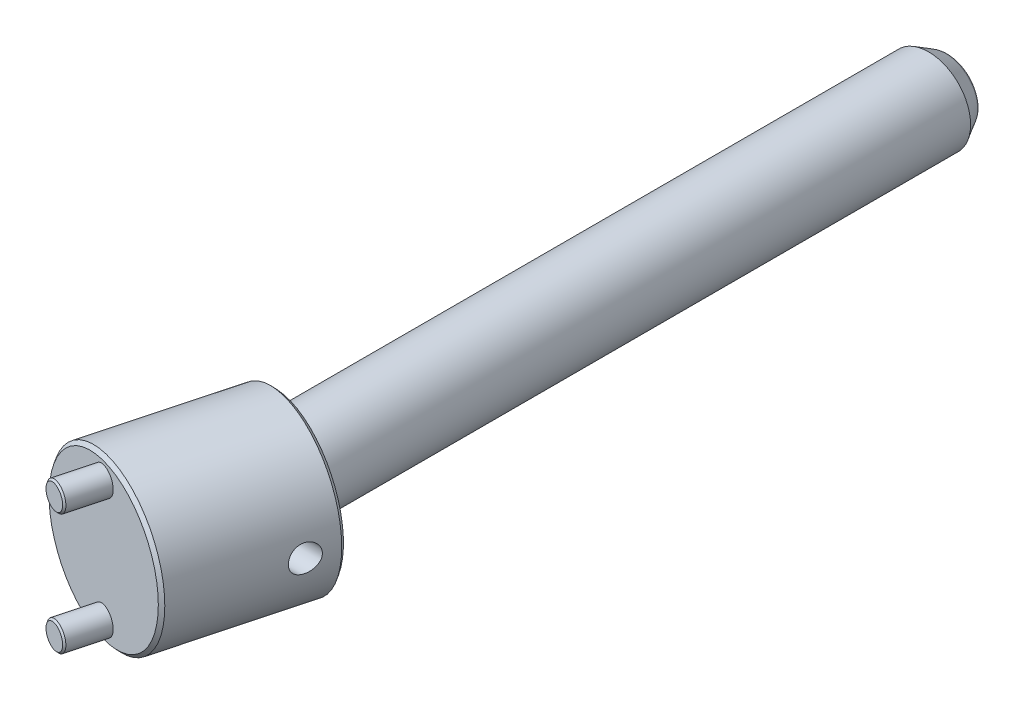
ISO-10303-21;
HEADER;
FILE_DESCRIPTION(('STEP AP214'),'2;1');
FILE_NAME('part.step','',(''),(''),'','','');
FILE_SCHEMA(('AUTOMOTIVE_DESIGN { 1 0 10303 214 1 1 1 1 }'));
ENDSEC;
DATA;
#1=APPLICATION_CONTEXT('core data for automotive mechanical design processes');
#2=APPLICATION_PROTOCOL_DEFINITION('international standard','automotive_design',2000,#1);
#3=PRODUCT_CONTEXT('',#1,'mechanical');
#4=PRODUCT('Part','Part','',(#3));
#5=PRODUCT_RELATED_PRODUCT_CATEGORY('part','',(#4));
#6=PRODUCT_DEFINITION_FORMATION('','',#4);
#7=PRODUCT_DEFINITION_CONTEXT('part definition',#1,'design');
#8=PRODUCT_DEFINITION('design','',#6,#7);
#9=PRODUCT_DEFINITION_SHAPE('','',#8);
#10=(LENGTH_UNIT() NAMED_UNIT(*) SI_UNIT(.MILLI.,.METRE.));
#11=(NAMED_UNIT(*) PLANE_ANGLE_UNIT() SI_UNIT($,.RADIAN.));
#12=(NAMED_UNIT(*) SI_UNIT($,.STERADIAN.) SOLID_ANGLE_UNIT());
#13=UNCERTAINTY_MEASURE_WITH_UNIT(LENGTH_MEASURE(1.E-05),#10,'distance_accuracy_value','');
#14=(GEOMETRIC_REPRESENTATION_CONTEXT(3) GLOBAL_UNCERTAINTY_ASSIGNED_CONTEXT((#13)) GLOBAL_UNIT_ASSIGNED_CONTEXT((#10,
#11,#12)) REPRESENTATION_CONTEXT('',''));
#15=CARTESIAN_POINT('',(0.,0.,0.));
#16=DIRECTION('',(0.,0.,1.));
#17=DIRECTION('',(1.,0.,0.));
#18=AXIS2_PLACEMENT_3D('',#15,#16,#17);
#19=CARTESIAN_POINT('',(-9.92305643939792,0.,56.3518673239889));
#20=DIRECTION('',(-0.258819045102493,0.,0.965925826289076));
#21=DIRECTION('',(-0.965925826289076,0.,-0.258819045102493));
#22=AXIS2_PLACEMENT_3D('',#19,#20,#21);
#23=PLANE('',#22);
#24=CARTESIAN_POINT('',(-9.92305643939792,18.,56.3518673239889));
#25=DIRECTION('',(-0.258819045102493,0.,0.965925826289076));
#26=DIRECTION('',(-0.965925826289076,0.,-0.258819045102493));
#27=AXIS2_PLACEMENT_3D('',#24,#25,#26);
#28=CIRCLE('',#27,3.50000030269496);
#29=CARTESIAN_POINT('',(-13.3037971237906,18.,55.446000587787));
#30=VERTEX_POINT('',#29);
#31=EDGE_CURVE('P0_E17',#30,#30,#28,.F.);
#32=ORIENTED_EDGE('',*,*,#31,.F.);
#33=EDGE_LOOP('',(#32));
#34=FACE_BOUND('',#33,.T.);
#35=ADVANCED_FACE('P0_F14',(#34),#23,.T.);
#36=CARTESIAN_POINT('',(-9.92305643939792,0.,56.3518673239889));
#37=DIRECTION('',(-0.258819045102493,0.,0.965925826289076));
#38=DIRECTION('',(-0.965925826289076,0.,-0.258819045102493));
#39=AXIS2_PLACEMENT_3D('',#36,#37,#38);
#40=PLANE('',#39);
#41=CARTESIAN_POINT('',(-9.92305643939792,-18.,56.3518673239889));
#42=DIRECTION('',(-0.258819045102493,0.,0.965925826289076));
#43=DIRECTION('',(-0.965925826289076,0.,-0.258819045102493));
#44=AXIS2_PLACEMENT_3D('',#41,#42,#43);
#45=CIRCLE('',#44,3.50000030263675);
#46=CARTESIAN_POINT('',(-13.3037971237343,-18.,55.446000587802));
#47=VERTEX_POINT('',#46);
#48=EDGE_CURVE('P0_E121',#47,#47,#45,.F.);
#49=ORIENTED_EDGE('',*,*,#48,.F.);
#50=EDGE_LOOP('',(#49));
#51=FACE_BOUND('',#50,.T.);
#52=ADVANCED_FACE('P0_F111',(#51),#40,.T.);
#53=CARTESIAN_POINT('',(3.59087759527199E-13,0.,37.4999999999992));
#54=DIRECTION('',(0.,0.,1.));
#55=DIRECTION('',(-1.,0.,0.));
#56=AXIS2_PLACEMENT_3D('',#53,#54,#55);
#57=PLANE('',#56);
#58=CARTESIAN_POINT('',(-9.31546506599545E-13,0.,37.4999999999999));
#59=DIRECTION('',(0.,0.,1.));
#60=DIRECTION('',(-1.,0.,0.));
#61=AXIS2_PLACEMENT_3D('',#58,#59,#60);
#62=CIRCLE('',#61,12.5);
#63=CARTESIAN_POINT('',(-12.5000000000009,0.,37.4999999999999));
#64=VERTEX_POINT('',#63);
#65=EDGE_CURVE('P0_E36',#64,#64,#62,.F.);
#66=ORIENTED_EDGE('',*,*,#65,.T.);
#67=EDGE_LOOP('',(#66));
#68=FACE_BOUND('',#67,.T.);
#69=ADVANCED_FACE('P0_F108',(#68),#57,.F.);
#70=CARTESIAN_POINT('',(-9.79364661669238,18.,55.8689032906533));
#71=DIRECTION('',(0.258819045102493,0.,-0.965925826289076));
#72=DIRECTION('',(0.965925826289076,0.,0.258819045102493));
#73=AXIS2_PLACEMENT_3D('',#70,#71,#72);
#74=CONICAL_SURFACE('',#73,4.00000150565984,0.785398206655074);
#75=CARTESIAN_POINT('',(-9.79364622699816,18.,55.8689018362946));
#76=DIRECTION('',(-0.258819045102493,0.,0.965925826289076));
#77=DIRECTION('',(-0.965925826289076,0.,-0.258819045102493));
#78=AXIS2_PLACEMENT_3D('',#75,#76,#77);
#79=CIRCLE('',#78,4.);
#80=CARTESIAN_POINT('',(-13.6573495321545,18.,54.8336256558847));
#81=VERTEX_POINT('',#80);
#82=EDGE_CURVE('P0_E33',#81,#81,#79,.F.);
#83=ORIENTED_EDGE('',*,*,#82,.F.);
#84=EDGE_LOOP('',(#83));
#85=FACE_BOUND('',#84,.T.);
#86=ORIENTED_EDGE('',*,*,#31,.T.);
#87=EDGE_LOOP('',(#86));
#88=FACE_BOUND('',#87,.T.);
#89=ADVANCED_FACE('P0_F104',(#85,#88),#74,.T.);
#90=CARTESIAN_POINT('',(-9.79364661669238,-18.,55.8689032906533));
#91=DIRECTION('',(0.258819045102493,0.,-0.965925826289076));
#92=DIRECTION('',(0.965925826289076,0.,0.258819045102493));
#93=AXIS2_PLACEMENT_3D('',#90,#91,#92);
#94=CONICAL_SURFACE('',#93,4.00000150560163,0.785398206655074);
#95=CARTESIAN_POINT('',(-9.79364622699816,-18.,55.8689018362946));
#96=DIRECTION('',(-0.258819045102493,0.,0.965925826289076));
#97=DIRECTION('',(-0.965925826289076,0.,-0.258819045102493));
#98=AXIS2_PLACEMENT_3D('',#95,#96,#97);
#99=CIRCLE('',#98,4.);
#100=CARTESIAN_POINT('',(-13.6573495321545,-18.,54.8336256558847));
#101=VERTEX_POINT('',#100);
#102=EDGE_CURVE('P0_E29',#101,#101,#99,.F.);
#103=ORIENTED_EDGE('',*,*,#102,.F.);
#104=EDGE_LOOP('',(#103));
#105=FACE_BOUND('',#104,.T.);
#106=ORIENTED_EDGE('',*,*,#48,.T.);
#107=EDGE_LOOP('',(#106));
#108=FACE_BOUND('',#107,.T.);
#109=ADVANCED_FACE('P0_F99',(#105,#108),#94,.T.);
#110=CARTESIAN_POINT('',(-9.33281230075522E-13,0.,-15.8125000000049));
#111=DIRECTION('',(0.,0.,1.));
#112=DIRECTION('',(-1.,0.,0.));
#113=AXIS2_PLACEMENT_3D('',#110,#111,#112);
#114=CYLINDRICAL_SURFACE('',#113,12.5);
#115=CARTESIAN_POINT('',(-9.31546506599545E-13,0.,-8.11850586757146E-13));
#116=DIRECTION('',(0.258819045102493,0.,-0.965925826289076));
#117=DIRECTION('',(0.965925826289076,0.,0.258819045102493));
#118=AXIS2_PLACEMENT_3D('',#115,#116,#117);
#119=ELLIPSE('',#118,12.9409522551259,12.5);
#120=CARTESIAN_POINT('',(12.4999999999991,0.,3.34936490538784));
#121=VERTEX_POINT('',#120);
#122=EDGE_CURVE('P0_E32',#121,#121,#119,.F.);
#123=ORIENTED_EDGE('',*,*,#122,.F.);
#124=EDGE_LOOP('',(#123));
#125=FACE_BOUND('',#124,.T.);
#126=ORIENTED_EDGE('',*,*,#65,.F.);
#127=EDGE_LOOP('',(#126));
#128=FACE_BOUND('',#127,.T.);
#129=CARTESIAN_POINT('',(12.4999999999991,0.,12.9999999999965));
#130=CARTESIAN_POINT('',(12.4999998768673,0.109267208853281,13.000000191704));
#131=CARTESIAN_POINT('',(12.4985638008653,0.218537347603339,13.0044812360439));
#132=CARTESIAN_POINT('',(12.4928582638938,0.436308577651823,13.0223652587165));
#133=CARTESIAN_POINT('',(12.4885877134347,0.544809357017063,13.0357716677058));
#134=CARTESIAN_POINT('',(12.4773197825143,0.760358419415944,13.0714127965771));
#135=CARTESIAN_POINT('',(12.4703188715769,0.867404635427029,13.0936589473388));
#136=CARTESIAN_POINT('',(12.4537844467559,1.07914970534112,13.1467710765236));
#137=CARTESIAN_POINT('',(12.4442499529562,1.18384763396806,13.1776403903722));
#138=CARTESIAN_POINT('',(12.41226080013,1.49277788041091,13.2826442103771));
#139=CARTESIAN_POINT('',(12.3863805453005,1.69256281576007,13.3692944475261));
#140=CARTESIAN_POINT('',(12.32816104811,2.07458913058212,13.5731871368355));
#141=CARTESIAN_POINT('',(12.295822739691,2.25683304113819,13.6904251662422));
#142=CARTESIAN_POINT('',(12.2269279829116,2.60472253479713,13.9562044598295));
#143=CARTESIAN_POINT('',(12.1902760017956,2.76972880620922,14.10555914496));
#144=CARTESIAN_POINT('',(12.1174284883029,3.07283077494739,14.4295989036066));
#145=CARTESIAN_POINT('',(12.0812330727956,3.21091970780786,14.6042903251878));
#146=CARTESIAN_POINT('',(12.0123702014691,3.45978450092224,14.9796324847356));
#147=CARTESIAN_POINT('',(11.9798194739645,3.56975347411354,15.1808417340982));
#148=CARTESIAN_POINT('',(11.9233663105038,3.75402351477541,15.6001070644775));
#149=CARTESIAN_POINT('',(11.8994614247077,3.82833468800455,15.818158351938));
#150=CARTESIAN_POINT('',(11.8640030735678,3.93682830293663,16.2577064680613));
#151=CARTESIAN_POINT('',(11.8520853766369,3.97219740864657,16.4788801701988));
#152=CARTESIAN_POINT('',(11.840870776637,4.00551082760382,16.9243189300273));
#153=CARTESIAN_POINT('',(11.8415703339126,4.00346563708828,17.1485831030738));
#154=CARTESIAN_POINT('',(11.855190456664,3.96293460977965,17.5839134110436));
#155=CARTESIAN_POINT('',(11.86760035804,3.92597140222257,17.7951400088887));
#156=CARTESIAN_POINT('',(11.9024113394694,3.81912665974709,18.2082211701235));
#157=CARTESIAN_POINT('',(11.9248135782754,3.74924130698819,18.4100746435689));
#158=CARTESIAN_POINT('',(11.9774670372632,3.5774893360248,18.8022499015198));
#159=CARTESIAN_POINT('',(12.0078322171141,3.47515345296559,18.9923501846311));
#160=CARTESIAN_POINT('',(12.0729382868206,3.2417276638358,19.353165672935));
#161=CARTESIAN_POINT('',(12.107680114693,3.11063158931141,19.5238767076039));
#162=CARTESIAN_POINT('',(12.1796519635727,2.81604951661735,19.8496284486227));
#163=CARTESIAN_POINT('',(12.2169216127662,2.65131653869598,20.0035328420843));
#164=CARTESIAN_POINT('',(12.2883204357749,2.29773509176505,20.2819176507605));
#165=CARTESIAN_POINT('',(12.3224482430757,2.10887621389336,20.4063852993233));
#166=CARTESIAN_POINT('',(12.3686038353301,1.8105187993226,20.5686214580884));
#167=CARTESIAN_POINT('',(12.3832112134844,1.70799133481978,20.6188153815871));
#168=CARTESIAN_POINT('',(12.4102662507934,1.49879447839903,20.7103404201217));
#169=CARTESIAN_POINT('',(12.4227147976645,1.39212681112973,20.751675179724));
#170=CARTESIAN_POINT('',(12.4450730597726,1.17558171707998,20.8250571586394));
#171=CARTESIAN_POINT('',(12.4549867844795,1.0657096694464,20.8571190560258));
#172=CARTESIAN_POINT('',(12.4720081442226,0.843458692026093,20.9117338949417));
#173=CARTESIAN_POINT('',(12.4791170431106,0.731080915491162,20.9342911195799));
#174=CARTESIAN_POINT('',(12.4897717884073,0.515800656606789,20.9679498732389));
#175=CARTESIAN_POINT('',(12.4935992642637,0.413053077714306,20.9799597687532));
#176=CARTESIAN_POINT('',(12.498713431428,0.206871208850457,20.9959849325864));
#177=CARTESIAN_POINT('',(12.5000001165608,0.103436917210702,21.0000001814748));
#178=CARTESIAN_POINT('',(12.4999998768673,-0.109267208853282,20.9999998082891));
#179=CARTESIAN_POINT('',(12.4985638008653,-0.21853734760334,20.9955187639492));
#180=CARTESIAN_POINT('',(12.4928582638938,-0.436308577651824,20.9776347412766));
#181=CARTESIAN_POINT('',(12.4885877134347,-0.544809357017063,20.9642283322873));
#182=CARTESIAN_POINT('',(12.4773197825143,-0.760358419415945,20.928587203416));
#183=CARTESIAN_POINT('',(12.4703188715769,-0.86740463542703,20.9063410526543));
#184=CARTESIAN_POINT('',(12.4537844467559,-1.07914970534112,20.8532289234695));
#185=CARTESIAN_POINT('',(12.4442499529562,-1.18384763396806,20.8223596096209));
#186=CARTESIAN_POINT('',(12.41226080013,-1.4927778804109,20.717355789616));
#187=CARTESIAN_POINT('',(12.3863805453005,-1.69256281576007,20.630705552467));
#188=CARTESIAN_POINT('',(12.32816104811,-2.07458913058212,20.4268128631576));
#189=CARTESIAN_POINT('',(12.295822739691,-2.25683304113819,20.3095748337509));
#190=CARTESIAN_POINT('',(12.2269279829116,-2.60472253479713,20.0437955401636));
#191=CARTESIAN_POINT('',(12.1902760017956,-2.76972880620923,19.8944408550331));
#192=CARTESIAN_POINT('',(12.1174284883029,-3.0728307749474,19.5704010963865));
#193=CARTESIAN_POINT('',(12.0812330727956,-3.21091970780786,19.3957096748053));
#194=CARTESIAN_POINT('',(12.0123702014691,-3.45978450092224,19.0203675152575));
#195=CARTESIAN_POINT('',(11.9798194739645,-3.56975347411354,18.8191582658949));
#196=CARTESIAN_POINT('',(11.9233663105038,-3.75402351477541,18.3998929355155));
#197=CARTESIAN_POINT('',(11.8994614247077,-3.82833468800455,18.1818416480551));
#198=CARTESIAN_POINT('',(11.8640030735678,-3.93682830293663,17.7422935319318));
#199=CARTESIAN_POINT('',(11.8520853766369,-3.97219740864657,17.5211198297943));
#200=CARTESIAN_POINT('',(11.840870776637,-4.00551082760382,17.0756810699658));
#201=CARTESIAN_POINT('',(11.8415703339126,-4.00346563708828,16.8514168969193));
#202=CARTESIAN_POINT('',(11.855190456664,-3.96293460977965,16.4160865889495));
#203=CARTESIAN_POINT('',(11.86760035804,-3.92597140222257,16.2048599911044));
#204=CARTESIAN_POINT('',(11.9024113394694,-3.81912665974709,15.7917788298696));
#205=CARTESIAN_POINT('',(11.9248135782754,-3.74924130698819,15.5899253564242));
#206=CARTESIAN_POINT('',(11.9774670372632,-3.5774893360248,15.1977500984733));
#207=CARTESIAN_POINT('',(12.0078322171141,-3.47515345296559,15.007649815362));
#208=CARTESIAN_POINT('',(12.0729382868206,-3.2417276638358,14.6468343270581));
#209=CARTESIAN_POINT('',(12.107680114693,-3.11063158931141,14.4761232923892));
#210=CARTESIAN_POINT('',(12.1796519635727,-2.81604951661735,14.1503715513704));
#211=CARTESIAN_POINT('',(12.2169216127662,-2.65131653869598,13.9964671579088));
#212=CARTESIAN_POINT('',(12.2883204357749,-2.29773509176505,13.7180823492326));
#213=CARTESIAN_POINT('',(12.3224482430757,-2.10887621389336,13.5936147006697));
#214=CARTESIAN_POINT('',(12.3686038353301,-1.8105187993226,13.4313785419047));
#215=CARTESIAN_POINT('',(12.3832112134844,-1.70799133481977,13.381184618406));
#216=CARTESIAN_POINT('',(12.4102662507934,-1.49879447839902,13.2896595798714));
#217=CARTESIAN_POINT('',(12.4227147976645,-1.39212681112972,13.2483248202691));
#218=CARTESIAN_POINT('',(12.4450730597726,-1.17558171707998,13.1749428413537));
#219=CARTESIAN_POINT('',(12.4549867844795,-1.0657096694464,13.1428809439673));
#220=CARTESIAN_POINT('',(12.4720081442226,-0.843458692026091,13.0882661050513));
#221=CARTESIAN_POINT('',(12.4791170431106,-0.731080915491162,13.0657088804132));
#222=CARTESIAN_POINT('',(12.4897717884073,-0.51580065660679,13.0320501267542));
#223=CARTESIAN_POINT('',(12.4935992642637,-0.413053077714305,13.0200402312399));
#224=CARTESIAN_POINT('',(12.498713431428,-0.206871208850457,13.0040150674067));
#225=CARTESIAN_POINT('',(12.5000001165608,-0.103436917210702,12.9999998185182));
#226=CARTESIAN_POINT('',(12.4999999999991,0.,12.9999999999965));
#227=B_SPLINE_CURVE_WITH_KNOTS('',3,(#129,#130,#131,#132,#133,#134,#135,#136,#137,#138,#139,
#140,#141,#142,#143,#144,#145,#146,#147,#148,#149,#150,#151,#152,#153,#154,#155,#156,#157,#158,
#159,#160,#161,#162,#163,#164,#165,#166,#167,#168,#169,#170,#171,#172,#173,#174,#175,#176,#177,
#178,#179,#180,#181,#182,#183,#184,#185,#186,#187,#188,#189,#190,#191,#192,#193,#194,#195,#196,
#197,#198,#199,#200,#201,#202,#203,#204,#205,#206,#207,#208,#209,#210,#211,#212,#213,#214,#215,
#216,#217,#218,#219,#220,#221,#222,#223,#224,#225,#226),.UNSPECIFIED.,.T.,.F.,(4,2,2,2,2,2,2,2,
2,2,2,2,2,2,2,2,2,2,2,2,2,2,2,2,2,2,2,2,2,2,2,2,2,2,2,2,2,2,2,2,2,2,2,2,2,2,2,2,4),(0.,
0.327705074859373,0.655536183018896,0.983792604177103,1.31217617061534,1.9667891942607,
2.62130761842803,3.29492000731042,3.96870146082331,4.66006760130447,5.35123768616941,
6.0207071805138,6.68998886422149,7.33137068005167,7.97282689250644,8.62401811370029,
9.27534913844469,9.95775723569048,10.6404607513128,10.9853574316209,11.3301119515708,
11.6743177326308,12.0183682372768,12.3285868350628,12.6388061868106,12.9665112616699,
13.2943423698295,13.6225987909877,13.9509823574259,14.6055953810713,15.2601138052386,
15.933726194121,16.6075076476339,17.298873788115,17.99004387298,18.6595133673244,
19.3287950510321,19.9701768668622,20.611633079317,21.2628243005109,21.9141553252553,
22.596563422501,23.2792669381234,23.6241636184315,23.9689181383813,24.3131239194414,
24.6571744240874,24.9673930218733,25.2776123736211),.UNSPECIFIED.);
#228=CARTESIAN_POINT('',(12.4999999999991,0.,12.9999999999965));
#229=VERTEX_POINT('',#228);
#230=EDGE_CURVE('P0_E84',#229,#229,#227,.T.);
#231=ORIENTED_EDGE('',*,*,#230,.T.);
#232=EDGE_LOOP('',(#231));
#233=FACE_BOUND('',#232,.T.);
#234=ADVANCED_FACE('P0_F93',(#125,#128,#233),#114,.F.);
#235=CARTESIAN_POINT('',(-6.817227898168,18.,44.76075740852));
#236=DIRECTION('',(-0.258819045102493,0.,0.965925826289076));
#237=DIRECTION('',(-0.965925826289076,0.,-0.258819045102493));
#238=AXIS2_PLACEMENT_3D('',#235,#236,#237);
#239=CYLINDRICAL_SURFACE('',#238,4.);
#240=CARTESIAN_POINT('',(-6.817227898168,18.,44.76075740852));
#241=DIRECTION('',(-0.258819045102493,0.,0.965925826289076));
#242=DIRECTION('',(-0.965925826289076,0.,-0.258819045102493));
#243=AXIS2_PLACEMENT_3D('',#240,#241,#242);
#244=CIRCLE('',#243,4.);
#245=CARTESIAN_POINT('',(-10.6809312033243,18.,43.72548122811));
#246=VERTEX_POINT('',#245);
#247=EDGE_CURVE('P0_E80',#246,#246,#244,.T.);
#248=ORIENTED_EDGE('',*,*,#247,.T.);
#249=EDGE_LOOP('',(#248));
#250=FACE_BOUND('',#249,.T.);
#251=ORIENTED_EDGE('',*,*,#82,.T.);
#252=EDGE_LOOP('',(#251));
#253=FACE_BOUND('',#252,.T.);
#254=ADVANCED_FACE('P0_F98',(#250,#253),#239,.T.);
#255=CARTESIAN_POINT('',(-6.817227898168,-18.,44.76075740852));
#256=DIRECTION('',(-0.258819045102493,0.,0.965925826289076));
#257=DIRECTION('',(-0.965925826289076,0.,-0.258819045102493));
#258=AXIS2_PLACEMENT_3D('',#255,#256,#257);
#259=CYLINDRICAL_SURFACE('',#258,4.);
#260=CARTESIAN_POINT('',(-6.817227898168,-18.,44.76075740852));
#261=DIRECTION('',(-0.258819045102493,0.,0.965925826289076));
#262=DIRECTION('',(-0.965925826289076,0.,-0.258819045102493));
#263=AXIS2_PLACEMENT_3D('',#260,#261,#262);
#264=CIRCLE('',#263,4.);
#265=CARTESIAN_POINT('',(-10.6809312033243,-18.,43.72548122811));
#266=VERTEX_POINT('',#265);
#267=EDGE_CURVE('P0_E76',#266,#266,#264,.T.);
#268=ORIENTED_EDGE('',*,*,#267,.T.);
#269=EDGE_LOOP('',(#268));
#270=FACE_BOUND('',#269,.T.);
#271=ORIENTED_EDGE('',*,*,#102,.T.);
#272=EDGE_LOOP('',(#271));
#273=FACE_BOUND('',#272,.T.);
#274=ADVANCED_FACE('P0_F178',(#270,#273),#259,.T.);
#275=CARTESIAN_POINT('',(4.82962913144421,0.,1.29409522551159));
#276=DIRECTION('',(0.258819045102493,0.,-0.965925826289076));
#277=DIRECTION('',(0.965925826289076,0.,0.258819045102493));
#278=AXIS2_PLACEMENT_3D('',#275,#276,#277);
#279=PLANE('',#278);
#280=ORIENTED_EDGE('',*,*,#122,.T.);
#281=EDGE_LOOP('',(#280));
#282=FACE_BOUND('',#281,.T.);
#283=CARTESIAN_POINT('',(4.82962908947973,0.,1.2940953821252));
#284=DIRECTION('',(-0.258819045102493,0.,0.965925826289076));
#285=DIRECTION('',(-0.965925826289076,0.,-0.258819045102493));
#286=AXIS2_PLACEMENT_3D('',#283,#284,#285);
#287=CIRCLE('',#286,22.9999993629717);
#288=CARTESIAN_POINT('',(-17.3866642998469,0.,-4.65874249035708));
#289=VERTEX_POINT('',#288);
#290=EDGE_CURVE('P0_E46',#289,#289,#287,.T.);
#291=ORIENTED_EDGE('',*,*,#290,.F.);
#292=EDGE_LOOP('',(#291));
#293=FACE_BOUND('',#292,.T.);
#294=ADVANCED_FACE('P0_F71',(#282,#293),#279,.T.);
#295=CARTESIAN_POINT('',(-6.54102540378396,0.,16.9999999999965));
#296=DIRECTION('',(1.,0.,0.));
#297=DIRECTION('',(0.,0.,1.));
#298=AXIS2_PLACEMENT_3D('',#295,#296,#297);
#299=CYLINDRICAL_SURFACE('',#298,4.);
#300=ORIENTED_EDGE('',*,*,#230,.F.);
#301=EDGE_LOOP('',(#300));
#302=FACE_BOUND('',#301,.T.);
#303=CARTESIAN_POINT('',(24.3960761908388,0.,20.9999999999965));
#304=CARTESIAN_POINT('',(24.396074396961,0.22336487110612,20.9999897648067));
#305=CARTESIAN_POINT('',(24.3978452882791,0.446995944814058,20.9812165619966));
#306=CARTESIAN_POINT('',(24.4051444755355,0.888215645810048,20.9065721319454));
#307=CARTESIAN_POINT('',(24.410679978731,1.10579184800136,20.8506297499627));
#308=CARTESIAN_POINT('',(24.4261201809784,1.52829524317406,20.703282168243));
#309=CARTESIAN_POINT('',(24.4360219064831,1.73323093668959,20.6119011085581));
#310=CARTESIAN_POINT('',(24.4610831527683,2.12464373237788,20.3964369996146));
#311=CARTESIAN_POINT('',(24.4762403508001,2.31112894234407,20.2723684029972));
#312=CARTESIAN_POINT('',(24.5128103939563,2.66027335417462,19.9954190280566));
#313=CARTESIAN_POINT('',(24.5342162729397,2.82295878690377,19.8425704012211));
#314=CARTESIAN_POINT('',(24.5842187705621,3.12024067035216,19.5126495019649));
#315=CARTESIAN_POINT('',(24.6128156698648,3.25483602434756,19.3355762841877));
#316=CARTESIAN_POINT('',(24.677846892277,3.49248622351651,18.9625212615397));
#317=CARTESIAN_POINT('',(24.7142870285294,3.59551753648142,18.7665254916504));
#318=CARTESIAN_POINT('',(24.7951246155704,3.76752154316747,18.3616777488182));
#319=CARTESIAN_POINT('',(24.8395223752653,3.83649291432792,18.1528252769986));
#320=CARTESIAN_POINT('',(24.9365267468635,3.93995184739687,17.7251836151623));
#321=CARTESIAN_POINT('',(24.9892449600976,3.97391481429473,17.5062931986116));
#322=CARTESIAN_POINT('',(25.1012847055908,4.00547425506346,17.0675971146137));
#323=CARTESIAN_POINT('',(25.1606074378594,4.00306410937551,16.8477912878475));
#324=CARTESIAN_POINT('',(25.286383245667,3.96197806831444,16.4051046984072));
#325=CARTESIAN_POINT('',(25.353015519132,3.92200742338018,16.1823953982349));
#326=CARTESIAN_POINT('',(25.4891731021,3.80555513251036,15.747634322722));
#327=CARTESIAN_POINT('',(25.5586991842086,3.72906367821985,15.5355854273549));
#328=CARTESIAN_POINT('',(25.7005200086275,3.53804999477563,15.1193979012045));
#329=CARTESIAN_POINT('',(25.7728177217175,3.42216994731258,14.9158834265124));
#330=CARTESIAN_POINT('',(25.9140135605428,3.15592185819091,14.5312374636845));
#331=CARTESIAN_POINT('',(25.9829114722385,3.00555164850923,14.3501073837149));
#332=CARTESIAN_POINT('',(26.0807528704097,2.75692219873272,14.0994318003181));
#333=CARTESIAN_POINT('',(26.1124676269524,2.67013706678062,14.0193319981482));
#334=CARTESIAN_POINT('',(26.1735791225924,2.48935348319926,13.8667774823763));
#335=CARTESIAN_POINT('',(26.202976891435,2.39535827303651,13.794319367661));
#336=CARTESIAN_POINT('',(26.258982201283,2.20066954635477,13.6576635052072));
#337=CARTESIAN_POINT('',(26.2855879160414,2.09997171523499,13.5934711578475));
#338=CARTESIAN_POINT('',(26.3354932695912,1.89266146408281,13.4740775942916));
#339=CARTESIAN_POINT('',(26.3587946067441,1.78605212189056,13.4188717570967));
#340=CARTESIAN_POINT('',(26.4003939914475,1.57406734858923,13.3209873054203));
#341=CARTESIAN_POINT('',(26.4189050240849,1.4689847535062,13.2777646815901));
#342=CARTESIAN_POINT('',(26.452252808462,1.25505058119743,13.2002919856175));
#343=CARTESIAN_POINT('',(26.4670914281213,1.14620095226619,13.1660373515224));
#344=CARTESIAN_POINT('',(26.492784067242,0.925790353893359,13.1069417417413));
#345=CARTESIAN_POINT('',(26.5036472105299,0.814236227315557,13.082079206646));
#346=CARTESIAN_POINT('',(26.5212085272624,0.589142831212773,13.0419746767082));
#347=CARTESIAN_POINT('',(26.5279093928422,0.47560489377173,13.0267264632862));
#348=CARTESIAN_POINT('',(26.5348605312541,0.301498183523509,13.010922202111));
#349=CARTESIAN_POINT('',(26.5366627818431,0.241289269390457,13.0068281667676));
#350=CARTESIAN_POINT('',(26.5390675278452,0.120722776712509,13.0013668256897));
#351=CARTESIAN_POINT('',(26.5396700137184,0.0603651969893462,12.9999995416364));
#352=CARTESIAN_POINT('',(26.5396692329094,-0.105931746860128,13.0000008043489));
#353=CARTESIAN_POINT('',(26.5378125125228,-0.211886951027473,13.0042135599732));
#354=CARTESIAN_POINT('',(26.5304173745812,-0.423042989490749,13.0210222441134));
#355=CARTESIAN_POINT('',(26.5248769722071,-0.52824338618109,13.0336226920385));
#356=CARTESIAN_POINT('',(26.5101984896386,-0.737264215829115,13.067105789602));
#357=CARTESIAN_POINT('',(26.5010540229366,-0.841081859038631,13.0880031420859));
#358=CARTESIAN_POINT('',(26.479333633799,-1.04641216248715,13.1378495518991));
#359=CARTESIAN_POINT('',(26.4667563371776,-1.14792388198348,13.1668018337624));
#360=CARTESIAN_POINT('',(26.4242739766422,-1.44724241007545,13.2651122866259));
#361=CARTESIAN_POINT('',(26.3895546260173,-1.64070757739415,13.3460666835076));
#362=CARTESIAN_POINT('',(26.3094786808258,-2.01073895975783,13.5358620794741));
#363=CARTESIAN_POINT('',(26.2641250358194,-2.1873098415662,13.6446953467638));
#364=CARTESIAN_POINT('',(26.1631694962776,-2.52718810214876,13.892056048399));
#365=CARTESIAN_POINT('',(26.1072150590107,-2.68961765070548,14.0316454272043));
#366=CARTESIAN_POINT('',(25.9893620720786,-2.98921976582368,14.3335692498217));
#367=CARTESIAN_POINT('',(25.927461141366,-3.12638215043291,14.4959128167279));
#368=CARTESIAN_POINT('',(25.7957403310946,-3.38223989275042,14.8524110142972));
#369=CARTESIAN_POINT('',(25.7256755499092,-3.49875562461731,15.0480426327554));
#370=CARTESIAN_POINT('',(25.5852116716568,-3.6970152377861,15.4561195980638));
#371=CARTESIAN_POINT('',(25.51481249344,-3.77875019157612,15.6685692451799));
#372=CARTESIAN_POINT('',(25.3741454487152,-3.90748115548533,16.1128925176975));
#373=CARTESIAN_POINT('',(25.3039724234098,-3.95312943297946,16.345189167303));
#374=CARTESIAN_POINT('',(25.1692372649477,-4.00275350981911,16.8158074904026));
#375=CARTESIAN_POINT('',(25.1046745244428,-4.00673382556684,17.0541285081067));
#376=CARTESIAN_POINT('',(24.9845370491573,-3.97228380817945,17.5249229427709));
#377=CARTESIAN_POINT('',(24.9288087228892,-3.93469783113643,17.7574181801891));
#378=CARTESIAN_POINT('',(24.8261443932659,-3.81859631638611,18.2139848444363));
#379=CARTESIAN_POINT('',(24.779206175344,-3.74009110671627,18.438058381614));
#380=CARTESIAN_POINT('',(24.6963951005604,-3.54797550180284,18.8610602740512));
#381=CARTESIAN_POINT('',(24.6601388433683,-3.43598653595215,19.0606507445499));
#382=CARTESIAN_POINT('',(24.5958853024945,-3.1788576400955,19.4386643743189));
#383=CARTESIAN_POINT('',(24.5678861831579,-3.03372509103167,19.6170922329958));
#384=CARTESIAN_POINT('',(24.5200172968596,-2.71870679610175,19.9425447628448));
#385=CARTESIAN_POINT('',(24.4999509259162,-2.5495830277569,20.0902790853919));
#386=CARTESIAN_POINT('',(24.4659141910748,-2.1885277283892,20.3556736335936));
#387=CARTESIAN_POINT('',(24.4519461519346,-1.99658753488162,20.473322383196));
#388=CARTESIAN_POINT('',(24.4291583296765,-1.5965468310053,20.6743616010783));
#389=CARTESIAN_POINT('',(24.4203123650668,-1.38853477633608,20.7579256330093));
#390=CARTESIAN_POINT('',(24.4068245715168,-0.961628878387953,20.8890823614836));
#391=CARTESIAN_POINT('',(24.4021747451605,-0.742756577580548,20.9367434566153));
#392=CARTESIAN_POINT('',(24.3982592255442,-0.435212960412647,20.9772137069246));
#393=CARTESIAN_POINT('',(24.3974390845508,-0.348403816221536,20.9857515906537));
#394=CARTESIAN_POINT('',(24.3963479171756,-0.174409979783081,20.9971467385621));
#395=CARTESIAN_POINT('',(24.3960768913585,-0.0872252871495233,21.000003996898));
#396=CARTESIAN_POINT('',(24.3960761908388,0.,20.9999999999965));
#397=B_SPLINE_CURVE_WITH_KNOTS('',3,(#303,#304,#305,#306,#307,#308,#309,#310,#311,#312,#313,
#314,#315,#316,#317,#318,#319,#320,#321,#322,#323,#324,#325,#326,#327,#328,#329,#330,#331,#332,
#333,#334,#335,#336,#337,#338,#339,#340,#341,#342,#343,#344,#345,#346,#347,#348,#349,#350,#351,
#352,#353,#354,#355,#356,#357,#358,#359,#360,#361,#362,#363,#364,#365,#366,#367,#368,#369,#370,
#371,#372,#373,#374,#375,#376,#377,#378,#379,#380,#381,#382,#383,#384,#385,#386,#387,#388,#389,
#390,#391,#392,#393,#394,#395,#396),.UNSPECIFIED.,.T.,.F.,(4,2,2,2,2,2,2,2,2,2,2,2,2,2,2,2,2,2,
2,2,2,2,2,2,2,2,2,2,2,2,2,2,2,2,2,2,2,2,2,2,2,2,2,2,2,2,4),(0.,0.669767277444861,
1.34082043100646,2.01141727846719,2.6817181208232,3.35127453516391,4.0208570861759,
4.69093762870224,5.36104418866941,6.04105231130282,6.72118419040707,7.4256558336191,
8.13031678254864,8.86226101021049,9.59425125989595,9.96071586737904,10.3270166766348,
10.6935556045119,11.0599054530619,11.4048180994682,11.7495549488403,12.0934955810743,
12.4372135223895,12.6182737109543,12.7993353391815,13.1170709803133,13.4349779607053,
13.7534508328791,14.0720513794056,14.7066198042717,15.3410124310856,16.0022589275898,
16.6637713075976,17.3752870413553,18.0869852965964,18.8241504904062,19.5612357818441,
20.2836188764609,21.0058197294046,21.6975404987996,22.3891073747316,23.0622604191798,
23.7356698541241,24.40560605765,25.0742627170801,25.3358104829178,25.5973585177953),.UNSPECIFIED.);
#398=CARTESIAN_POINT('',(24.3960761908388,0.,20.9999999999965));
#399=VERTEX_POINT('',#398);
#400=EDGE_CURVE('P0_E39',#399,#399,#397,.T.);
#401=ORIENTED_EDGE('',*,*,#400,.F.);
#402=EDGE_LOOP('',(#401));
#403=FACE_BOUND('',#402,.T.);
#404=ADVANCED_FACE('P0_F48',(#302,#403),#299,.F.);
#405=CARTESIAN_POINT('',(-6.817227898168,0.,44.76075740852));
#406=DIRECTION('',(0.258819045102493,0.,-0.965925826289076));
#407=DIRECTION('',(0.965925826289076,0.,0.258819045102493));
#408=AXIS2_PLACEMENT_3D('',#405,#406,#407);
#409=PLANE('',#408);
#410=ORIENTED_EDGE('',*,*,#267,.F.);
#411=EDGE_LOOP('',(#410));
#412=FACE_BOUND('',#411,.T.);
#413=ORIENTED_EDGE('',*,*,#247,.F.);
#414=EDGE_LOOP('',(#413));
#415=FACE_BOUND('',#414,.T.);
#416=CARTESIAN_POINT('',(-6.81722788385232,0.,44.7607573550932));
#417=DIRECTION('',(0.258819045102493,0.,-0.965925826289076));
#418=DIRECTION('',(0.965925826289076,0.,0.258819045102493));
#419=AXIS2_PLACEMENT_3D('',#416,#417,#418);
#420=CIRCLE('',#419,22.9999993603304);
#421=CARTESIAN_POINT('',(15.399065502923,0.,50.7135952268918));
#422=VERTEX_POINT('',#421);
#423=EDGE_CURVE('P0_E26',#422,#422,#420,.T.);
#424=ORIENTED_EDGE('',*,*,#423,.F.);
#425=EDGE_LOOP('',(#424));
#426=FACE_BOUND('',#425,.T.);
#427=ADVANCED_FACE('P0_F63',(#412,#415,#426),#409,.F.);
#428=CARTESIAN_POINT('',(4.57080991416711,0.,2.26002169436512));
#429=DIRECTION('',(-0.258819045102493,0.,0.965925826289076));
#430=DIRECTION('',(-0.965925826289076,0.,-0.258819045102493));
#431=AXIS2_PLACEMENT_3D('',#428,#429,#430);
#432=CONICAL_SURFACE('',#431,23.9999998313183,0.785398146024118);
#433=ORIENTED_EDGE('',*,*,#290,.T.);
#434=EDGE_LOOP('',(#433));
#435=FACE_BOUND('',#434,.T.);
#436=CARTESIAN_POINT('',(4.57080995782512,0.,2.26002153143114));
#437=DIRECTION('',(0.258819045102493,0.,-0.965925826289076));
#438=DIRECTION('',(0.965925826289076,0.,0.258819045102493));
#439=AXIS2_PLACEMENT_3D('',#436,#437,#438);
#440=CIRCLE('',#439,24.);
#441=CARTESIAN_POINT('',(27.7530297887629,0.,8.47167861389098));
#442=VERTEX_POINT('',#441);
#443=EDGE_CURVE('P0_E21',#442,#442,#440,.F.);
#444=ORIENTED_EDGE('',*,*,#443,.F.);
#445=EDGE_LOOP('',(#444));
#446=FACE_BOUND('',#445,.T.);
#447=ADVANCED_FACE('P0_F60',(#435,#446),#432,.T.);
#448=CARTESIAN_POINT('',(-6.55840868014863,0.,43.7948309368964));
#449=DIRECTION('',(0.258819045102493,0.,-0.965925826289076));
#450=DIRECTION('',(0.965925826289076,0.,0.258819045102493));
#451=AXIS2_PLACEMENT_3D('',#448,#449,#450);
#452=CONICAL_SURFACE('',#451,23.9999999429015,0.785398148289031);
#453=CARTESIAN_POINT('',(-6.55840869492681,0.,43.7948309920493));
#454=DIRECTION('',(0.258819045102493,0.,-0.965925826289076));
#455=DIRECTION('',(0.965925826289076,0.,0.258819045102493));
#456=AXIS2_PLACEMENT_3D('',#453,#454,#455);
#457=CIRCLE('',#456,24.);
#458=CARTESIAN_POINT('',(16.623811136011,0.,50.0064880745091));
#459=VERTEX_POINT('',#458);
#460=EDGE_CURVE('P0_E9',#459,#459,#457,.T.);
#461=ORIENTED_EDGE('',*,*,#460,.F.);
#462=EDGE_LOOP('',(#461));
#463=FACE_BOUND('',#462,.T.);
#464=ORIENTED_EDGE('',*,*,#423,.T.);
#465=EDGE_LOOP('',(#464));
#466=FACE_BOUND('',#465,.T.);
#467=ADVANCED_FACE('P0_F56',(#463,#466),#452,.T.);
#468=CARTESIAN_POINT('',(-7.39957074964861,0.,46.9340905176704));
#469=DIRECTION('',(0.258819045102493,0.,-0.965925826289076));
#470=DIRECTION('',(0.965925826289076,0.,0.258819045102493));
#471=AXIS2_PLACEMENT_3D('',#468,#469,#470);
#472=CYLINDRICAL_SURFACE('',#471,24.);
#473=ORIENTED_EDGE('',*,*,#443,.T.);
#474=EDGE_LOOP('',(#473));
#475=FACE_BOUND('',#474,.T.);
#476=ORIENTED_EDGE('',*,*,#460,.T.);
#477=EDGE_LOOP('',(#476));
#478=FACE_BOUND('',#477,.T.);
#479=ORIENTED_EDGE('',*,*,#400,.T.);
#480=EDGE_LOOP('',(#479));
#481=FACE_BOUND('',#480,.T.);
#482=ADVANCED_FACE('P0_F52',(#475,#478,#481),#472,.T.);
#483=CLOSED_SHELL('',(#35,#52,#69,#89,#109,#234,#254,#274,#294,#404,#427,#447,#467,#482));
#484=MANIFOLD_SOLID_BREP('P0_B1',#483);
#485=CARTESIAN_POINT('',(0.,0.,-200.));
#486=DIRECTION('',(0.,0.,-1.));
#487=DIRECTION('',(0.,1.,0.));
#488=AXIS2_PLACEMENT_3D('',#485,#486,#487);
#489=PLANE('',#488);
#490=CARTESIAN_POINT('',(0.,0.,-200.));
#491=DIRECTION('',(0.,0.,1.));
#492=DIRECTION('',(-1.,0.,0.));
#493=AXIS2_PLACEMENT_3D('',#490,#491,#492);
#494=CIRCLE('',#493,7.881197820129);
#495=CARTESIAN_POINT('',(-7.8811978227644,0.,-200.));
#496=VERTEX_POINT('',#495);
#497=CARTESIAN_POINT('',(7.8811978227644,0.,-200.));
#498=VERTEX_POINT('',#497);
#499=EDGE_CURVE('P1_E38',#496,#498,#494,.T.);
#500=ORIENTED_EDGE('',*,*,#499,.F.);
#501=CARTESIAN_POINT('',(0.,0.,-200.));
#502=DIRECTION('',(0.,0.,1.));
#503=DIRECTION('',(1.,0.,0.));
#504=AXIS2_PLACEMENT_3D('',#501,#502,#503);
#505=CIRCLE('',#504,7.881197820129);
#506=EDGE_CURVE('P1_E42',#498,#496,#505,.T.);
#507=ORIENTED_EDGE('',*,*,#506,.F.);
#508=EDGE_LOOP('',(#500,#507));
#509=FACE_BOUND('',#508,.T.);
#510=ADVANCED_FACE('P1_F17',(#509),#489,.T.);
#511=CARTESIAN_POINT('',(0.,0.,-198.));
#512=DIRECTION('',(0.,0.,-1.));
#513=DIRECTION('',(0.999976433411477,-0.00686532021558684,0.));
#514=AXIS2_PLACEMENT_3D('',#511,#512,#513);
#515=TOROIDAL_SURFACE('',#514,7.881197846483,2.);
#516=ORIENTED_EDGE('',*,*,#499,.T.);
#517=ORIENTED_EDGE('',*,*,#506,.T.);
#518=EDGE_LOOP('',(#516,#517));
#519=FACE_BOUND('',#518,.T.);
#520=CARTESIAN_POINT('',(0.,0.,-199.000000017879));
#521=DIRECTION('',(0.,0.,1.));
#522=DIRECTION('',(1.,0.,0.));
#523=AXIS2_PLACEMENT_3D('',#520,#521,#522);
#524=CIRCLE('',#523,9.61324864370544);
#525=CARTESIAN_POINT('',(9.61324864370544,0.,-199.000000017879));
#526=VERTEX_POINT('',#525);
#527=EDGE_CURVE('P1_E48',#526,#526,#524,.T.);
#528=ORIENTED_EDGE('',*,*,#527,.F.);
#529=EDGE_LOOP('',(#528));
#530=FACE_BOUND('',#529,.T.);
#531=ADVANCED_FACE('P1_F40',(#519,#530),#515,.T.);
#532=CARTESIAN_POINT('',(0.,0.,37.5));
#533=DIRECTION('',(0.,0.,-1.));
#534=DIRECTION('',(0.,1.,0.));
#535=AXIS2_PLACEMENT_3D('',#532,#533,#534);
#536=PLANE('',#535);
#537=CARTESIAN_POINT('',(0.,0.,37.5));
#538=DIRECTION('',(0.,0.,-1.));
#539=DIRECTION('',(0.,1.,0.));
#540=AXIS2_PLACEMENT_3D('',#537,#538,#539);
#541=CIRCLE('',#540,11.4999975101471);
#542=CARTESIAN_POINT('',(0.,11.4999975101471,37.5));
#543=VERTEX_POINT('',#542);
#544=EDGE_CURVE('P1_E85',#543,#543,#541,.T.);
#545=ORIENTED_EDGE('',*,*,#544,.F.);
#546=EDGE_LOOP('',(#545));
#547=FACE_BOUND('',#546,.T.);
#548=ADVANCED_FACE('P1_F76',(#547),#536,.F.);
#549=CARTESIAN_POINT('',(4.30940107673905,0.,17.));
#550=DIRECTION('',(1.,0.,0.));
#551=DIRECTION('',(0.,0.,1.));
#552=AXIS2_PLACEMENT_3D('',#549,#550,#551);
#553=CONICAL_SURFACE('',#552,3.9999999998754,1.04719755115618);
#554=CARTESIAN_POINT('',(1.99999999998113,0.,16.9999999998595));
#555=VERTEX_POINT('',#554);
#556=VERTEX_LOOP('',#555);
#557=FACE_BOUND('',#556,.T.);
#558=CARTESIAN_POINT('',(4.309401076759,0.,17.));
#559=DIRECTION('',(1.,0.,0.));
#560=DIRECTION('',(0.,0.,1.));
#561=AXIS2_PLACEMENT_3D('',#558,#559,#560);
#562=CIRCLE('',#561,4.);
#563=CARTESIAN_POINT('',(4.309401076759,0.,21.));
#564=VERTEX_POINT('',#563);
#565=EDGE_CURVE('P1_E82',#564,#564,#562,.T.);
#566=ORIENTED_EDGE('',*,*,#565,.T.);
#567=EDGE_LOOP('',(#566));
#568=FACE_BOUND('',#567,.T.);
#569=ADVANCED_FACE('P1_F116',(#557,#568),#553,.F.);
#570=CARTESIAN_POINT('',(0.,0.,-193.999999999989));
#571=DIRECTION('',(0.,0.,1.));
#572=DIRECTION('',(0.,-1.,0.));
#573=AXIS2_PLACEMENT_3D('',#570,#571,#572);
#574=CONICAL_SURFACE('',#573,12.4999999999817,0.5235987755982);
#575=CARTESIAN_POINT('',(0.,0.,-194.));
#576=DIRECTION('',(0.,0.,-1.));
#577=DIRECTION('',(0.,1.,0.));
#578=AXIS2_PLACEMENT_3D('',#575,#576,#577);
#579=CIRCLE('',#578,12.5);
#580=CARTESIAN_POINT('',(0.,12.5,-194.));
#581=VERTEX_POINT('',#580);
#582=EDGE_CURVE('P1_E92',#581,#581,#579,.F.);
#583=ORIENTED_EDGE('',*,*,#582,.F.);
#584=EDGE_LOOP('',(#583));
#585=FACE_BOUND('',#584,.T.);
#586=ORIENTED_EDGE('',*,*,#527,.T.);
#587=EDGE_LOOP('',(#586));
#588=FACE_BOUND('',#587,.T.);
#589=ADVANCED_FACE('P1_F108',(#585,#588),#574,.T.);
#590=CARTESIAN_POINT('',(0.,0.,36.4999985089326));
#591=DIRECTION('',(0.,0.,-1.));
#592=DIRECTION('',(0.,1.,0.));
#593=AXIS2_PLACEMENT_3D('',#590,#591,#592);
#594=CONICAL_SURFACE('',#593,12.4999987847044,0.785398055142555);
#595=CARTESIAN_POINT('',(0.,0.,36.499999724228));
#596=DIRECTION('',(0.,0.,-1.));
#597=DIRECTION('',(0.,1.,0.));
#598=AXIS2_PLACEMENT_3D('',#595,#596,#597);
#599=CIRCLE('',#598,12.5);
#600=CARTESIAN_POINT('',(0.,12.5,36.499999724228));
#601=VERTEX_POINT('',#600);
#602=EDGE_CURVE('P1_E28',#601,#601,#599,.T.);
#603=ORIENTED_EDGE('',*,*,#602,.F.);
#604=EDGE_LOOP('',(#603));
#605=FACE_BOUND('',#604,.T.);
#606=ORIENTED_EDGE('',*,*,#544,.T.);
#607=EDGE_LOOP('',(#606));
#608=FACE_BOUND('',#607,.T.);
#609=ADVANCED_FACE('P1_F105',(#605,#608),#594,.T.);
#610=CARTESIAN_POINT('',(1.375,0.,17.));
#611=DIRECTION('',(1.,0.,0.));
#612=DIRECTION('',(0.,0.,1.));
#613=AXIS2_PLACEMENT_3D('',#610,#611,#612);
#614=CYLINDRICAL_SURFACE('',#613,4.);
#615=ORIENTED_EDGE('',*,*,#565,.F.);
#616=EDGE_LOOP('',(#615));
#617=FACE_BOUND('',#616,.T.);
#618=CARTESIAN_POINT('',(12.5,0.,21.));
#619=CARTESIAN_POINT('',(12.4999998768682,0.109267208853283,20.9999998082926));
#620=CARTESIAN_POINT('',(12.4985638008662,0.218537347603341,20.9955187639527));
#621=CARTESIAN_POINT('',(12.4928582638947,0.436308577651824,20.9776347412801));
#622=CARTESIAN_POINT('',(12.4885877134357,0.544809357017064,20.9642283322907));
#623=CARTESIAN_POINT('',(12.4773197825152,0.760358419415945,20.9285872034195));
#624=CARTESIAN_POINT('',(12.4703188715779,0.867404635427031,20.9063410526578));
#625=CARTESIAN_POINT('',(12.4537844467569,1.07914970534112,20.853228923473));
#626=CARTESIAN_POINT('',(12.4442499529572,1.18384763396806,20.8223596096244));
#627=CARTESIAN_POINT('',(12.412260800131,1.49277788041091,20.7173557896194));
#628=CARTESIAN_POINT('',(12.3863805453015,1.69256281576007,20.6307055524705));
#629=CARTESIAN_POINT('',(12.3281610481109,2.07458913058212,20.4268128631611));
#630=CARTESIAN_POINT('',(12.295822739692,2.25683304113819,20.3095748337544));
#631=CARTESIAN_POINT('',(12.2269279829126,2.60472253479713,20.043795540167));
#632=CARTESIAN_POINT('',(12.1902760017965,2.76972880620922,19.8944408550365));
#633=CARTESIAN_POINT('',(12.1174284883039,3.07283077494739,19.5704010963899));
#634=CARTESIAN_POINT('',(12.0812330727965,3.21091970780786,19.3957096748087));
#635=CARTESIAN_POINT('',(12.01237020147,3.45978450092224,19.0203675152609));
#636=CARTESIAN_POINT('',(11.9798194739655,3.56975347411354,18.8191582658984));
#637=CARTESIAN_POINT('',(11.9233663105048,3.75402351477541,18.399892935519));
#638=CARTESIAN_POINT('',(11.8994614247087,3.82833468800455,18.1818416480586));
#639=CARTESIAN_POINT('',(11.8640030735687,3.93682830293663,17.7422935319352));
#640=CARTESIAN_POINT('',(11.8520853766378,3.97219740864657,17.5211198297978));
#641=CARTESIAN_POINT('',(11.8408707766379,4.00551082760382,17.0756810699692));
#642=CARTESIAN_POINT('',(11.8415703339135,4.00346563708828,16.8514168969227));
#643=CARTESIAN_POINT('',(11.8551904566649,3.96293460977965,16.4160865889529));
#644=CARTESIAN_POINT('',(11.8676003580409,3.92597140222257,16.2048599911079));
#645=CARTESIAN_POINT('',(11.9024113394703,3.81912665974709,15.791778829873));
#646=CARTESIAN_POINT('',(11.9248135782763,3.74924130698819,15.5899253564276));
#647=CARTESIAN_POINT('',(11.9774670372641,3.5774893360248,15.1977500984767));
#648=CARTESIAN_POINT('',(12.0078322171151,3.47515345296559,15.0076498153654));
#649=CARTESIAN_POINT('',(12.0729382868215,3.2417276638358,14.6468343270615));
#650=CARTESIAN_POINT('',(12.107680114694,3.11063158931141,14.4761232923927));
#651=CARTESIAN_POINT('',(12.1796519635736,2.81604951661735,14.1503715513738));
#652=CARTESIAN_POINT('',(12.2169216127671,2.65131653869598,13.9964671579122));
#653=CARTESIAN_POINT('',(12.2883204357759,2.29773509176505,13.7180823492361));
#654=CARTESIAN_POINT('',(12.3224482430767,2.10887621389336,13.5936147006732));
#655=CARTESIAN_POINT('',(12.368603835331,1.8105187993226,13.4313785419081));
#656=CARTESIAN_POINT('',(12.3832112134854,1.70799133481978,13.3811846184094));
#657=CARTESIAN_POINT('',(12.4102662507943,1.49879447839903,13.2896595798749));
#658=CARTESIAN_POINT('',(12.4227147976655,1.39212681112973,13.2483248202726));
#659=CARTESIAN_POINT('',(12.4450730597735,1.17558171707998,13.1749428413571));
#660=CARTESIAN_POINT('',(12.4549867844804,1.0657096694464,13.1428809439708));
#661=CARTESIAN_POINT('',(12.4720081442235,0.843458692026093,13.0882661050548));
#662=CARTESIAN_POINT('',(12.4791170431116,0.731080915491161,13.0657088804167));
#663=CARTESIAN_POINT('',(12.4897717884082,0.515800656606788,13.0320501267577));
#664=CARTESIAN_POINT('',(12.4935992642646,0.413053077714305,13.0200402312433));
#665=CARTESIAN_POINT('',(12.498713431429,0.206871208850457,13.0040150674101));
#666=CARTESIAN_POINT('',(12.5000001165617,0.103436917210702,12.9999998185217));
#667=CARTESIAN_POINT('',(12.4999998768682,-0.109267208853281,13.0000001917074));
#668=CARTESIAN_POINT('',(12.4985638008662,-0.218537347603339,13.0044812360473));
#669=CARTESIAN_POINT('',(12.4928582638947,-0.436308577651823,13.0223652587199));
#670=CARTESIAN_POINT('',(12.4885877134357,-0.544809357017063,13.0357716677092));
#671=CARTESIAN_POINT('',(12.4773197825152,-0.760358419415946,13.0714127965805));
#672=CARTESIAN_POINT('',(12.4703188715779,-0.867404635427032,13.0936589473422));
#673=CARTESIAN_POINT('',(12.4537844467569,-1.07914970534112,13.146771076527));
#674=CARTESIAN_POINT('',(12.4442499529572,-1.18384763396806,13.1776403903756));
#675=CARTESIAN_POINT('',(12.412260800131,-1.4927778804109,13.2826442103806));
#676=CARTESIAN_POINT('',(12.3863805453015,-1.69256281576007,13.3692944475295));
#677=CARTESIAN_POINT('',(12.3281610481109,-2.07458913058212,13.5731871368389));
#678=CARTESIAN_POINT('',(12.295822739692,-2.25683304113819,13.6904251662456));
#679=CARTESIAN_POINT('',(12.2269279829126,-2.60472253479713,13.956204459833));
#680=CARTESIAN_POINT('',(12.1902760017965,-2.76972880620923,14.1055591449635));
#681=CARTESIAN_POINT('',(12.1174284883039,-3.0728307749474,14.4295989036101));
#682=CARTESIAN_POINT('',(12.0812330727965,-3.21091970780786,14.6042903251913));
#683=CARTESIAN_POINT('',(12.01237020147,-3.45978450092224,14.9796324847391));
#684=CARTESIAN_POINT('',(11.9798194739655,-3.56975347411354,15.1808417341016));
#685=CARTESIAN_POINT('',(11.9233663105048,-3.75402351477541,15.600107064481));
#686=CARTESIAN_POINT('',(11.8994614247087,-3.82833468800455,15.8181583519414));
#687=CARTESIAN_POINT('',(11.8640030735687,-3.93682830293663,16.2577064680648));
#688=CARTESIAN_POINT('',(11.8520853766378,-3.97219740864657,16.4788801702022));
#689=CARTESIAN_POINT('',(11.8408707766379,-4.00551082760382,16.9243189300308));
#690=CARTESIAN_POINT('',(11.8415703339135,-4.00346563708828,17.1485831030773));
#691=CARTESIAN_POINT('',(11.8551904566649,-3.96293460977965,17.583913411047));
#692=CARTESIAN_POINT('',(11.8676003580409,-3.92597140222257,17.7951400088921));
#693=CARTESIAN_POINT('',(11.9024113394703,-3.81912665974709,18.208221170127));
#694=CARTESIAN_POINT('',(11.9248135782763,-3.74924130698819,18.4100746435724));
#695=CARTESIAN_POINT('',(11.9774670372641,-3.5774893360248,18.8022499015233));
#696=CARTESIAN_POINT('',(12.0078322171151,-3.47515345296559,18.9923501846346));
#697=CARTESIAN_POINT('',(12.0729382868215,-3.2417276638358,19.3531656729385));
#698=CARTESIAN_POINT('',(12.107680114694,-3.11063158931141,19.5238767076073));
#699=CARTESIAN_POINT('',(12.1796519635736,-2.81604951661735,19.8496284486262));
#700=CARTESIAN_POINT('',(12.2169216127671,-2.65131653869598,20.0035328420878));
#701=CARTESIAN_POINT('',(12.2883204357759,-2.29773509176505,20.2819176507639));
#702=CARTESIAN_POINT('',(12.3224482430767,-2.10887621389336,20.4063852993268));
#703=CARTESIAN_POINT('',(12.368603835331,-1.8105187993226,20.5686214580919));
#704=CARTESIAN_POINT('',(12.3832112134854,-1.70799133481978,20.6188153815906));
#705=CARTESIAN_POINT('',(12.4102662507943,-1.49879447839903,20.7103404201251));
#706=CARTESIAN_POINT('',(12.4227147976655,-1.39212681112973,20.7516751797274));
#707=CARTESIAN_POINT('',(12.4450730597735,-1.17558171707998,20.8250571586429));
#708=CARTESIAN_POINT('',(12.4549867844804,-1.0657096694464,20.8571190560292));
#709=CARTESIAN_POINT('',(12.4720081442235,-0.843458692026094,20.9117338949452));
#710=CARTESIAN_POINT('',(12.4791170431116,-0.731080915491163,20.9342911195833));
#711=CARTESIAN_POINT('',(12.4897717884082,-0.515800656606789,20.9679498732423));
#712=CARTESIAN_POINT('',(12.4935992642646,-0.413053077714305,20.9799597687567));
#713=CARTESIAN_POINT('',(12.498713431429,-0.206871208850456,20.9959849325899));
#714=CARTESIAN_POINT('',(12.5000001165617,-0.103436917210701,21.0000001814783));
#715=CARTESIAN_POINT('',(12.5,0.,21.));
#716=B_SPLINE_CURVE_WITH_KNOTS('',3,(#618,#619,#620,#621,#622,#623,#624,#625,#626,#627,#628,
#629,#630,#631,#632,#633,#634,#635,#636,#637,#638,#639,#640,#641,#642,#643,#644,#645,#646,#647,
#648,#649,#650,#651,#652,#653,#654,#655,#656,#657,#658,#659,#660,#661,#662,#663,#664,#665,#666,
#667,#668,#669,#670,#671,#672,#673,#674,#675,#676,#677,#678,#679,#680,#681,#682,#683,#684,#685,
#686,#687,#688,#689,#690,#691,#692,#693,#694,#695,#696,#697,#698,#699,#700,#701,#702,#703,#704,
#705,#706,#707,#708,#709,#710,#711,#712,#713,#714,#715),.UNSPECIFIED.,.T.,.F.,(4,2,2,2,2,2,2,2,
2,2,2,2,2,2,2,2,2,2,2,2,2,2,2,2,2,2,2,2,2,2,2,2,2,2,2,2,2,2,2,2,2,2,2,2,2,2,2,2,4),(0.,
0.327705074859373,0.655536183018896,0.983792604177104,1.31217617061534,1.96678919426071,
2.62130761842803,3.29492000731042,3.96870146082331,4.66006760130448,5.35123768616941,
6.0207071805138,6.68998886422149,7.33137068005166,7.97282689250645,8.62401811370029,
9.27534913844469,9.95775723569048,10.6404607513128,10.9853574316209,11.3301119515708,
11.6743177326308,12.0183682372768,12.3285868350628,12.6388061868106,12.9665112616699,
13.2943423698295,13.6225987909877,13.9509823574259,14.6055953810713,15.2601138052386,
15.933726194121,16.6075076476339,17.298873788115,17.99004387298,18.6595133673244,
19.3287950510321,19.9701768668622,20.611633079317,21.2628243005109,21.9141553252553,
22.596563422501,23.2792669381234,23.6241636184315,23.9689181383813,24.3131239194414,
24.6571744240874,24.9673930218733,25.2776123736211),.UNSPECIFIED.);
#717=CARTESIAN_POINT('',(12.5,0.,21.));
#718=VERTEX_POINT('',#717);
#719=EDGE_CURVE('P1_E11',#718,#718,#716,.T.);
#720=ORIENTED_EDGE('',*,*,#719,.F.);
#721=EDGE_LOOP('',(#720));
#722=FACE_BOUND('',#721,.T.);
#723=ADVANCED_FACE('P1_F107',(#617,#722),#614,.F.);
#724=CARTESIAN_POINT('',(0.,0.,49.375));
#725=DIRECTION('',(0.,0.,-1.));
#726=DIRECTION('',(0.,1.,0.));
#727=AXIS2_PLACEMENT_3D('',#724,#725,#726);
#728=CYLINDRICAL_SURFACE('',#727,12.5);
#729=ORIENTED_EDGE('',*,*,#582,.T.);
#730=EDGE_LOOP('',(#729));
#731=FACE_BOUND('',#730,.T.);
#732=ORIENTED_EDGE('',*,*,#602,.T.);
#733=EDGE_LOOP('',(#732));
#734=FACE_BOUND('',#733,.T.);
#735=ORIENTED_EDGE('',*,*,#719,.T.);
#736=EDGE_LOOP('',(#735));
#737=FACE_BOUND('',#736,.T.);
#738=ADVANCED_FACE('P1_F102',(#731,#734,#737),#728,.T.);
#739=CLOSED_SHELL('',(#510,#531,#548,#569,#589,#609,#723,#738));
#740=MANIFOLD_SOLID_BREP('P1_B1',#739);
#741=ADVANCED_BREP_SHAPE_REPRESENTATION('',(#18,#484,#740),#14);
#742=SHAPE_DEFINITION_REPRESENTATION(#9,#741);
ENDSEC;
END-ISO-10303-21;
